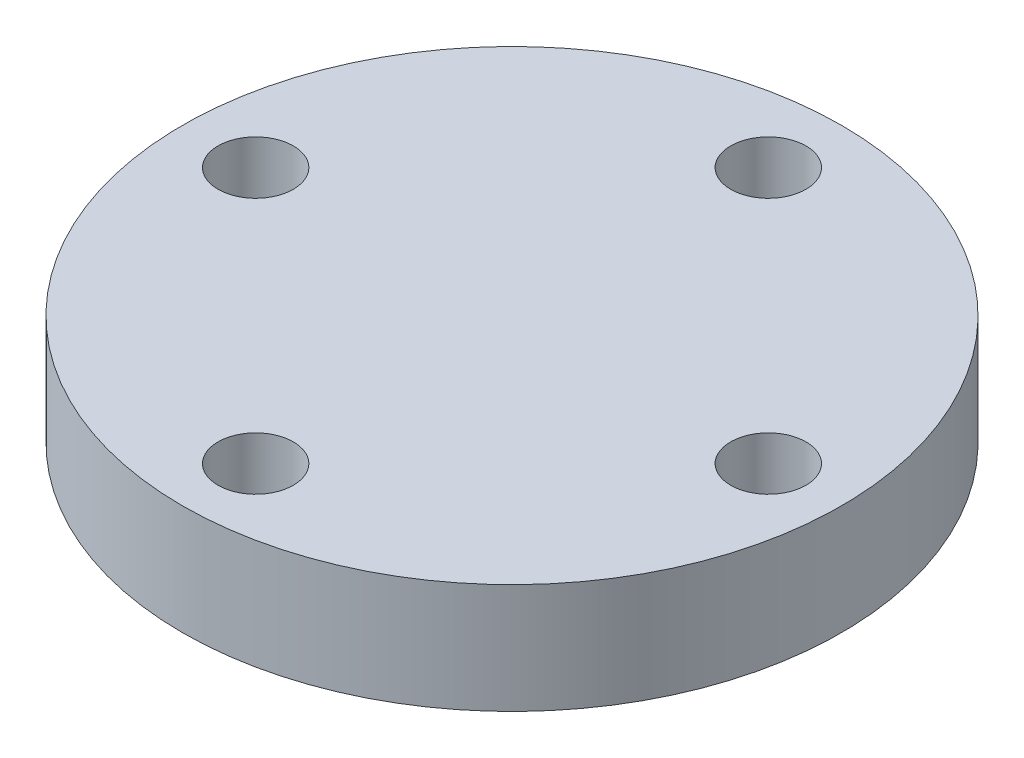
ISO-10303-21;
HEADER;
FILE_DESCRIPTION(('STEP AP214'),'2;1');
FILE_NAME('part.step','',(''),(''),'','','');
FILE_SCHEMA(('AUTOMOTIVE_DESIGN { 1 0 10303 214 1 1 1 1 }'));
ENDSEC;
DATA;
#1=APPLICATION_CONTEXT('core data for automotive mechanical design processes');
#2=APPLICATION_PROTOCOL_DEFINITION('international standard','automotive_design',2000,#1);
#3=PRODUCT_CONTEXT('',#1,'mechanical');
#4=PRODUCT('Part','Part','',(#3));
#5=PRODUCT_RELATED_PRODUCT_CATEGORY('part','',(#4));
#6=PRODUCT_DEFINITION_FORMATION('','',#4);
#7=PRODUCT_DEFINITION_CONTEXT('part definition',#1,'design');
#8=PRODUCT_DEFINITION('design','',#6,#7);
#9=PRODUCT_DEFINITION_SHAPE('','',#8);
#10=(LENGTH_UNIT() NAMED_UNIT(*) SI_UNIT(.MILLI.,.METRE.));
#11=(NAMED_UNIT(*) PLANE_ANGLE_UNIT() SI_UNIT($,.RADIAN.));
#12=(NAMED_UNIT(*) SI_UNIT($,.STERADIAN.) SOLID_ANGLE_UNIT());
#13=UNCERTAINTY_MEASURE_WITH_UNIT(LENGTH_MEASURE(1.E-05),#10,'distance_accuracy_value','');
#14=(GEOMETRIC_REPRESENTATION_CONTEXT(3) GLOBAL_UNCERTAINTY_ASSIGNED_CONTEXT((#13)) GLOBAL_UNIT_ASSIGNED_CONTEXT((#10,
#11,#12)) REPRESENTATION_CONTEXT('',''));
#15=CARTESIAN_POINT('',(0.,0.,0.));
#16=DIRECTION('',(0.,0.,1.));
#17=DIRECTION('',(1.,0.,0.));
#18=AXIS2_PLACEMENT_3D('',#15,#16,#17);
#19=CARTESIAN_POINT('',(0.,9.525,0.));
#20=DIRECTION('',(0.,-1.,0.));
#21=DIRECTION('',(0.,0.,-1.));
#22=AXIS2_PLACEMENT_3D('',#19,#20,#21);
#23=CYLINDRICAL_SURFACE('',#22,28.575);
#24=CARTESIAN_POINT('',(0.,9.525,0.));
#25=DIRECTION('',(0.,1.,0.));
#26=DIRECTION('',(0.,0.,1.));
#27=AXIS2_PLACEMENT_3D('',#24,#25,#26);
#28=CIRCLE('',#27,28.575);
#29=CARTESIAN_POINT('',(0.,9.525,-28.575));
#30=VERTEX_POINT('',#29);
#31=EDGE_CURVE('E10',#30,#30,#28,.T.);
#32=CARTESIAN_POINT('',(0.,0.,0.));
#33=DIRECTION('',(0.,1.,0.));
#34=DIRECTION('',(0.,0.,1.));
#35=AXIS2_PLACEMENT_3D('',#32,#33,#34);
#36=CIRCLE('',#35,28.575);
#37=CARTESIAN_POINT('',(0.,0.,-28.575));
#38=VERTEX_POINT('',#37);
#39=EDGE_CURVE('E35',#38,#38,#36,.T.);
#40=CARTESIAN_POINT('',(0.,9.525,-28.575));
#41=CARTESIAN_POINT('',(0.,9.42578125,-28.575));
#42=CARTESIAN_POINT('',(0.,9.3265625,-28.575));
#43=CARTESIAN_POINT('',(0.,9.128125,-28.575));
#44=CARTESIAN_POINT('',(0.,9.02890625,-28.575));
#45=CARTESIAN_POINT('',(0.,8.83046875,-28.575));
#46=CARTESIAN_POINT('',(0.,8.73125,-28.575));
#47=CARTESIAN_POINT('',(0.,8.5328125,-28.575));
#48=CARTESIAN_POINT('',(0.,8.43359375,-28.575));
#49=CARTESIAN_POINT('',(0.,8.23515625,-28.575));
#50=CARTESIAN_POINT('',(0.,8.1359375,-28.575));
#51=CARTESIAN_POINT('',(0.,7.9375,-28.575));
#52=CARTESIAN_POINT('',(0.,7.83828125,-28.575));
#53=CARTESIAN_POINT('',(0.,7.63984375,-28.575));
#54=CARTESIAN_POINT('',(0.,7.540625,-28.575));
#55=CARTESIAN_POINT('',(0.,7.3421875,-28.575));
#56=CARTESIAN_POINT('',(0.,7.24296875,-28.575));
#57=CARTESIAN_POINT('',(0.,7.04453125,-28.575));
#58=CARTESIAN_POINT('',(0.,6.9453125,-28.575));
#59=CARTESIAN_POINT('',(0.,6.746875,-28.575));
#60=CARTESIAN_POINT('',(0.,6.64765625,-28.575));
#61=CARTESIAN_POINT('',(0.,6.44921875,-28.575));
#62=CARTESIAN_POINT('',(0.,6.35,-28.575));
#63=CARTESIAN_POINT('',(0.,6.1515625,-28.575));
#64=CARTESIAN_POINT('',(0.,6.05234375,-28.575));
#65=CARTESIAN_POINT('',(0.,5.85390625,-28.575));
#66=CARTESIAN_POINT('',(0.,5.7546875,-28.575));
#67=CARTESIAN_POINT('',(0.,5.55625,-28.575));
#68=CARTESIAN_POINT('',(0.,5.45703125,-28.575));
#69=CARTESIAN_POINT('',(0.,5.25859375,-28.575));
#70=CARTESIAN_POINT('',(0.,5.159375,-28.575));
#71=CARTESIAN_POINT('',(0.,4.9609375,-28.575));
#72=CARTESIAN_POINT('',(0.,4.86171875,-28.575));
#73=CARTESIAN_POINT('',(0.,4.66328125,-28.575));
#74=CARTESIAN_POINT('',(0.,4.5640625,-28.575));
#75=CARTESIAN_POINT('',(0.,4.365625,-28.575));
#76=CARTESIAN_POINT('',(0.,4.26640625,-28.575));
#77=CARTESIAN_POINT('',(0.,4.06796875,-28.575));
#78=CARTESIAN_POINT('',(0.,3.96875,-28.575));
#79=CARTESIAN_POINT('',(0.,3.7703125,-28.575));
#80=CARTESIAN_POINT('',(0.,3.67109375,-28.575));
#81=CARTESIAN_POINT('',(0.,3.47265625,-28.575));
#82=CARTESIAN_POINT('',(0.,3.3734375,-28.575));
#83=CARTESIAN_POINT('',(0.,3.175,-28.575));
#84=CARTESIAN_POINT('',(0.,3.07578125,-28.575));
#85=CARTESIAN_POINT('',(0.,2.87734375,-28.575));
#86=CARTESIAN_POINT('',(0.,2.778125,-28.575));
#87=CARTESIAN_POINT('',(0.,2.5796875,-28.575));
#88=CARTESIAN_POINT('',(0.,2.48046875,-28.575));
#89=CARTESIAN_POINT('',(0.,2.28203125,-28.575));
#90=CARTESIAN_POINT('',(0.,2.1828125,-28.575));
#91=CARTESIAN_POINT('',(0.,1.984375,-28.575));
#92=CARTESIAN_POINT('',(0.,1.88515625,-28.575));
#93=CARTESIAN_POINT('',(0.,1.68671875,-28.575));
#94=CARTESIAN_POINT('',(0.,1.5875,-28.575));
#95=CARTESIAN_POINT('',(0.,1.3890625,-28.575));
#96=CARTESIAN_POINT('',(0.,1.28984375,-28.575));
#97=CARTESIAN_POINT('',(0.,1.09140625,-28.575));
#98=CARTESIAN_POINT('',(0.,0.992187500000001,-28.575));
#99=CARTESIAN_POINT('',(0.,0.793750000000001,-28.575));
#100=CARTESIAN_POINT('',(0.,0.69453125,-28.575));
#101=CARTESIAN_POINT('',(0.,0.49609375,-28.575));
#102=CARTESIAN_POINT('',(0.,0.396875,-28.575));
#103=CARTESIAN_POINT('',(0.,0.1984375,-28.575));
#104=CARTESIAN_POINT('',(0.,0.0992187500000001,-28.575));
#105=CARTESIAN_POINT('',(0.,0.,-28.575));
#106=B_SPLINE_CURVE_WITH_KNOTS('',3,(#40,#41,#42,#43,#44,#45,#46,#47,#48,#49,#50,#51,#52,#53,
#54,#55,#56,#57,#58,#59,#60,#61,#62,#63,#64,#65,#66,#67,#68,#69,#70,#71,#72,#73,#74,#75,#76,#77,
#78,#79,#80,#81,#82,#83,#84,#85,#86,#87,#88,#89,#90,#91,#92,#93,#94,#95,#96,#97,#98,#99,#100,
#101,#102,#103,#104,#105),.UNSPECIFIED.,.F.,.F.,(4,2,2,2,2,2,2,2,2,2,2,2,2,2,2,2,2,2,2,2,2,2,2,
2,2,2,2,2,2,2,2,2,4),(0.,0.297656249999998,0.595312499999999,0.892968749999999,1.190625,
1.48828125,1.7859375,2.08359375,2.38125,2.67890625,2.9765625,3.27421875,3.571875,3.86953125,
4.1671875,4.46484375,4.7625,5.06015625,5.3578125,5.65546875,5.953125,6.25078125,6.5484375,
6.84609375,7.14375,7.44140625,7.7390625,8.03671875,8.334375,8.63203125,8.9296875,9.22734375,
9.525),.UNSPECIFIED.);
#107=EDGE_CURVE('BSEAM32',#30,#38,#106,.T.);
#108=ORIENTED_EDGE('',*,*,#31,.F.);
#109=ORIENTED_EDGE('',*,*,#39,.T.);
#110=ORIENTED_EDGE('',*,*,#107,.T.);
#111=ORIENTED_EDGE('',*,*,#107,.F.);
#112=EDGE_LOOP('',(#108,#110,#109,#111));
#113=FACE_BOUND('',#112,.T.);
#114=ADVANCED_FACE('F32',(#113),#23,.T.);
#115=CARTESIAN_POINT('',(0.,9.525,0.));
#116=DIRECTION('',(0.,1.,0.));
#117=DIRECTION('',(0.,0.,1.));
#118=AXIS2_PLACEMENT_3D('',#115,#116,#117);
#119=PLANE('',#118);
#120=CARTESIAN_POINT('',(0.,9.525,-22.225));
#121=DIRECTION('',(0.,1.,0.));
#122=DIRECTION('',(0.,0.,1.));
#123=AXIS2_PLACEMENT_3D('',#120,#121,#122);
#124=CIRCLE('',#123,3.2639);
#125=CARTESIAN_POINT('',(0.,9.525,-18.9611));
#126=VERTEX_POINT('',#125);
#127=EDGE_CURVE('E62',#126,#126,#124,.T.);
#128=ORIENTED_EDGE('',*,*,#127,.F.);
#129=EDGE_LOOP('',(#128));
#130=FACE_BOUND('',#129,.T.);
#131=CARTESIAN_POINT('',(22.225,9.525,0.));
#132=DIRECTION('',(0.,1.,0.));
#133=DIRECTION('',(0.,0.,1.));
#134=AXIS2_PLACEMENT_3D('',#131,#132,#133);
#135=CIRCLE('',#134,3.2639);
#136=CARTESIAN_POINT('',(22.225,9.525,3.26390000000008));
#137=VERTEX_POINT('',#136);
#138=EDGE_CURVE('E56',#137,#137,#135,.T.);
#139=ORIENTED_EDGE('',*,*,#138,.F.);
#140=EDGE_LOOP('',(#139));
#141=FACE_BOUND('',#140,.T.);
#142=CARTESIAN_POINT('',(1.25790142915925E-12,9.525,22.225));
#143=DIRECTION('',(0.,1.,0.));
#144=DIRECTION('',(0.,0.,1.));
#145=AXIS2_PLACEMENT_3D('',#142,#143,#144);
#146=CIRCLE('',#145,3.2639);
#147=CARTESIAN_POINT('',(1.25790142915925E-12,9.525,25.4889));
#148=VERTEX_POINT('',#147);
#149=EDGE_CURVE('E50',#148,#148,#146,.T.);
#150=ORIENTED_EDGE('',*,*,#149,.F.);
#151=EDGE_LOOP('',(#150));
#152=FACE_BOUND('',#151,.T.);
#153=CARTESIAN_POINT('',(-22.2249999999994,9.525,6.31672492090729E-13));
#154=DIRECTION('',(0.,1.,0.));
#155=DIRECTION('',(0.,0.,1.));
#156=AXIS2_PLACEMENT_3D('',#153,#154,#155);
#157=CIRCLE('',#156,3.2639);
#158=CARTESIAN_POINT('',(-22.2249999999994,9.525,3.26390000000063));
#159=VERTEX_POINT('',#158);
#160=EDGE_CURVE('E44',#159,#159,#157,.T.);
#161=ORIENTED_EDGE('',*,*,#160,.F.);
#162=EDGE_LOOP('',(#161));
#163=FACE_BOUND('',#162,.T.);
#164=ORIENTED_EDGE('',*,*,#31,.T.);
#165=EDGE_LOOP('',(#164));
#166=FACE_BOUND('',#165,.T.);
#167=ADVANCED_FACE('F78',(#130,#141,#152,#163,#166),#119,.T.);
#168=CARTESIAN_POINT('',(0.,0.,0.));
#169=DIRECTION('',(0.,1.,0.));
#170=DIRECTION('',(0.,0.,1.));
#171=AXIS2_PLACEMENT_3D('',#168,#169,#170);
#172=PLANE('',#171);
#173=CARTESIAN_POINT('',(0.,0.,-22.225));
#174=DIRECTION('',(0.,1.,0.));
#175=DIRECTION('',(0.,0.,1.));
#176=AXIS2_PLACEMENT_3D('',#173,#174,#175);
#177=CIRCLE('',#176,3.2639);
#178=CARTESIAN_POINT('',(0.,0.,-18.9611));
#179=VERTEX_POINT('',#178);
#180=EDGE_CURVE('E42',#179,#179,#177,.T.);
#181=ORIENTED_EDGE('',*,*,#180,.T.);
#182=EDGE_LOOP('',(#181));
#183=FACE_BOUND('',#182,.T.);
#184=CARTESIAN_POINT('',(22.225,0.,0.));
#185=DIRECTION('',(0.,1.,0.));
#186=DIRECTION('',(0.,0.,1.));
#187=AXIS2_PLACEMENT_3D('',#184,#185,#186);
#188=CIRCLE('',#187,3.2639);
#189=CARTESIAN_POINT('',(22.225,0.,3.26390000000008));
#190=VERTEX_POINT('',#189);
#191=EDGE_CURVE('E59',#190,#190,#188,.T.);
#192=ORIENTED_EDGE('',*,*,#191,.T.);
#193=EDGE_LOOP('',(#192));
#194=FACE_BOUND('',#193,.T.);
#195=CARTESIAN_POINT('',(1.25790142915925E-12,0.,22.225));
#196=DIRECTION('',(0.,1.,0.));
#197=DIRECTION('',(0.,0.,1.));
#198=AXIS2_PLACEMENT_3D('',#195,#196,#197);
#199=CIRCLE('',#198,3.2639);
#200=CARTESIAN_POINT('',(1.25790142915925E-12,0.,25.4889));
#201=VERTEX_POINT('',#200);
#202=EDGE_CURVE('E53',#201,#201,#199,.T.);
#203=ORIENTED_EDGE('',*,*,#202,.T.);
#204=EDGE_LOOP('',(#203));
#205=FACE_BOUND('',#204,.T.);
#206=CARTESIAN_POINT('',(-22.2249999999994,0.,6.31672492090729E-13));
#207=DIRECTION('',(0.,1.,0.));
#208=DIRECTION('',(0.,0.,1.));
#209=AXIS2_PLACEMENT_3D('',#206,#207,#208);
#210=CIRCLE('',#209,3.2639);
#211=CARTESIAN_POINT('',(-22.2249999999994,0.,3.26390000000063));
#212=VERTEX_POINT('',#211);
#213=EDGE_CURVE('E47',#212,#212,#210,.T.);
#214=ORIENTED_EDGE('',*,*,#213,.T.);
#215=EDGE_LOOP('',(#214));
#216=FACE_BOUND('',#215,.T.);
#217=ORIENTED_EDGE('',*,*,#39,.F.);
#218=EDGE_LOOP('',(#217));
#219=FACE_BOUND('',#218,.T.);
#220=ADVANCED_FACE('F68',(#183,#194,#205,#216,#219),#172,.F.);
#221=CARTESIAN_POINT('',(-22.2249999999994,0.,6.31672492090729E-13));
#222=DIRECTION('',(0.,1.,0.));
#223=DIRECTION('',(0.,0.,1.));
#224=AXIS2_PLACEMENT_3D('',#221,#222,#223);
#225=CYLINDRICAL_SURFACE('',#224,3.2639);
#226=CARTESIAN_POINT('',(-22.2249999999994,0.,3.26390000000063));
#227=CARTESIAN_POINT('',(-22.2249999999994,0.0992187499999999,3.26390000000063));
#228=CARTESIAN_POINT('',(-22.2249999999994,0.1984375,3.26390000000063));
#229=CARTESIAN_POINT('',(-22.2249999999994,0.396875,3.26390000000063));
#230=CARTESIAN_POINT('',(-22.2249999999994,0.49609375,3.26390000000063));
#231=CARTESIAN_POINT('',(-22.2249999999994,0.69453125,3.26390000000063));
#232=CARTESIAN_POINT('',(-22.2249999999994,0.79375,3.26390000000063));
#233=CARTESIAN_POINT('',(-22.2249999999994,0.9921875,3.26390000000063));
#234=CARTESIAN_POINT('',(-22.2249999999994,1.09140625,3.26390000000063));
#235=CARTESIAN_POINT('',(-22.2249999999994,1.28984375,3.26390000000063));
#236=CARTESIAN_POINT('',(-22.2249999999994,1.3890625,3.26390000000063));
#237=CARTESIAN_POINT('',(-22.2249999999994,1.5875,3.26390000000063));
#238=CARTESIAN_POINT('',(-22.2249999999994,1.68671875,3.26390000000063));
#239=CARTESIAN_POINT('',(-22.2249999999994,1.88515625,3.26390000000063));
#240=CARTESIAN_POINT('',(-22.2249999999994,1.984375,3.26390000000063));
#241=CARTESIAN_POINT('',(-22.2249999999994,2.1828125,3.26390000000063));
#242=CARTESIAN_POINT('',(-22.2249999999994,2.28203125,3.26390000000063));
#243=CARTESIAN_POINT('',(-22.2249999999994,2.48046875,3.26390000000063));
#244=CARTESIAN_POINT('',(-22.2249999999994,2.5796875,3.26390000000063));
#245=CARTESIAN_POINT('',(-22.2249999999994,2.778125,3.26390000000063));
#246=CARTESIAN_POINT('',(-22.2249999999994,2.87734375,3.26390000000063));
#247=CARTESIAN_POINT('',(-22.2249999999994,3.07578125,3.26390000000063));
#248=CARTESIAN_POINT('',(-22.2249999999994,3.175,3.26390000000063));
#249=CARTESIAN_POINT('',(-22.2249999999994,3.3734375,3.26390000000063));
#250=CARTESIAN_POINT('',(-22.2249999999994,3.47265625,3.26390000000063));
#251=CARTESIAN_POINT('',(-22.2249999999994,3.67109375,3.26390000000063));
#252=CARTESIAN_POINT('',(-22.2249999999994,3.7703125,3.26390000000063));
#253=CARTESIAN_POINT('',(-22.2249999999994,3.96875,3.26390000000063));
#254=CARTESIAN_POINT('',(-22.2249999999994,4.06796875,3.26390000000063));
#255=CARTESIAN_POINT('',(-22.2249999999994,4.26640625,3.26390000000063));
#256=CARTESIAN_POINT('',(-22.2249999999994,4.365625,3.26390000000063));
#257=CARTESIAN_POINT('',(-22.2249999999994,4.5640625,3.26390000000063));
#258=CARTESIAN_POINT('',(-22.2249999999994,4.66328125,3.26390000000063));
#259=CARTESIAN_POINT('',(-22.2249999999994,4.86171875,3.26390000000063));
#260=CARTESIAN_POINT('',(-22.2249999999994,4.9609375,3.26390000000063));
#261=CARTESIAN_POINT('',(-22.2249999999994,5.159375,3.26390000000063));
#262=CARTESIAN_POINT('',(-22.2249999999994,5.25859375,3.26390000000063));
#263=CARTESIAN_POINT('',(-22.2249999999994,5.45703125,3.26390000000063));
#264=CARTESIAN_POINT('',(-22.2249999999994,5.55625,3.26390000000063));
#265=CARTESIAN_POINT('',(-22.2249999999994,5.7546875,3.26390000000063));
#266=CARTESIAN_POINT('',(-22.2249999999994,5.85390625,3.26390000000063));
#267=CARTESIAN_POINT('',(-22.2249999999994,6.05234375,3.26390000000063));
#268=CARTESIAN_POINT('',(-22.2249999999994,6.1515625,3.26390000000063));
#269=CARTESIAN_POINT('',(-22.2249999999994,6.35,3.26390000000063));
#270=CARTESIAN_POINT('',(-22.2249999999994,6.44921875,3.26390000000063));
#271=CARTESIAN_POINT('',(-22.2249999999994,6.64765625,3.26390000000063));
#272=CARTESIAN_POINT('',(-22.2249999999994,6.746875,3.26390000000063));
#273=CARTESIAN_POINT('',(-22.2249999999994,6.9453125,3.26390000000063));
#274=CARTESIAN_POINT('',(-22.2249999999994,7.04453125,3.26390000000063));
#275=CARTESIAN_POINT('',(-22.2249999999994,7.24296875,3.26390000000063));
#276=CARTESIAN_POINT('',(-22.2249999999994,7.3421875,3.26390000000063));
#277=CARTESIAN_POINT('',(-22.2249999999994,7.540625,3.26390000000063));
#278=CARTESIAN_POINT('',(-22.2249999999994,7.63984375,3.26390000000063));
#279=CARTESIAN_POINT('',(-22.2249999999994,7.83828125,3.26390000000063));
#280=CARTESIAN_POINT('',(-22.2249999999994,7.9375,3.26390000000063));
#281=CARTESIAN_POINT('',(-22.2249999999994,8.1359375,3.26390000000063));
#282=CARTESIAN_POINT('',(-22.2249999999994,8.23515625,3.26390000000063));
#283=CARTESIAN_POINT('',(-22.2249999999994,8.43359375,3.26390000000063));
#284=CARTESIAN_POINT('',(-22.2249999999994,8.5328125,3.26390000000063));
#285=CARTESIAN_POINT('',(-22.2249999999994,8.73125,3.26390000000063));
#286=CARTESIAN_POINT('',(-22.2249999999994,8.83046875,3.26390000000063));
#287=CARTESIAN_POINT('',(-22.2249999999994,9.02890625,3.26390000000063));
#288=CARTESIAN_POINT('',(-22.2249999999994,9.128125,3.26390000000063));
#289=CARTESIAN_POINT('',(-22.2249999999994,9.3265625,3.26390000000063));
#290=CARTESIAN_POINT('',(-22.2249999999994,9.42578125,3.26390000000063));
#291=CARTESIAN_POINT('',(-22.2249999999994,9.525,3.26390000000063));
#292=B_SPLINE_CURVE_WITH_KNOTS('',3,(#226,#227,#228,#229,#230,#231,#232,#233,#234,#235,#236,
#237,#238,#239,#240,#241,#242,#243,#244,#245,#246,#247,#248,#249,#250,#251,#252,#253,#254,#255,
#256,#257,#258,#259,#260,#261,#262,#263,#264,#265,#266,#267,#268,#269,#270,#271,#272,#273,#274,
#275,#276,#277,#278,#279,#280,#281,#282,#283,#284,#285,#286,#287,#288,#289,#290,#291),
.UNSPECIFIED.,.F.,.F.,(4,2,2,2,2,2,2,2,2,2,2,2,2,2,2,2,2,2,2,2,2,2,2,2,2,2,2,2,2,2,2,2,4),(0.,
0.29765625,0.5953125,0.89296875,1.190625,1.48828125,1.7859375,2.08359375,2.38125,2.67890625,
2.9765625,3.27421875,3.571875,3.86953125,4.1671875,4.46484375,4.7625,5.06015625,5.3578125,
5.65546875,5.953125,6.25078125,6.5484375,6.84609375,7.14375,7.44140625,7.7390625,8.03671875,
8.334375,8.63203125,8.9296875,9.22734375,9.525),.UNSPECIFIED.);
#293=EDGE_CURVE('BSEAM88',#212,#159,#292,.T.);
#294=ORIENTED_EDGE('',*,*,#213,.F.);
#295=ORIENTED_EDGE('',*,*,#160,.T.);
#296=ORIENTED_EDGE('',*,*,#293,.T.);
#297=ORIENTED_EDGE('',*,*,#293,.F.);
#298=EDGE_LOOP('',(#294,#296,#295,#297));
#299=FACE_BOUND('',#298,.T.);
#300=ADVANCED_FACE('F88',(#299),#225,.F.);
#301=CARTESIAN_POINT('',(1.25790142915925E-12,0.,22.225));
#302=DIRECTION('',(0.,1.,0.));
#303=DIRECTION('',(0.,0.,1.));
#304=AXIS2_PLACEMENT_3D('',#301,#302,#303);
#305=CYLINDRICAL_SURFACE('',#304,3.2639);
#306=CARTESIAN_POINT('',(1.25790142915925E-12,0.,25.4889));
#307=CARTESIAN_POINT('',(1.25790142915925E-12,0.0992187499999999,25.4889));
#308=CARTESIAN_POINT('',(1.25790142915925E-12,0.1984375,25.4889));
#309=CARTESIAN_POINT('',(1.25790142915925E-12,0.396875,25.4889));
#310=CARTESIAN_POINT('',(1.25790142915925E-12,0.49609375,25.4889));
#311=CARTESIAN_POINT('',(1.25790142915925E-12,0.69453125,25.4889));
#312=CARTESIAN_POINT('',(1.25790142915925E-12,0.79375,25.4889));
#313=CARTESIAN_POINT('',(1.25790142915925E-12,0.9921875,25.4889));
#314=CARTESIAN_POINT('',(1.25790142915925E-12,1.09140625,25.4889));
#315=CARTESIAN_POINT('',(1.25790142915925E-12,1.28984375,25.4889));
#316=CARTESIAN_POINT('',(1.25790142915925E-12,1.3890625,25.4889));
#317=CARTESIAN_POINT('',(1.25790142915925E-12,1.5875,25.4889));
#318=CARTESIAN_POINT('',(1.25790142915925E-12,1.68671875,25.4889));
#319=CARTESIAN_POINT('',(1.25790142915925E-12,1.88515625,25.4889));
#320=CARTESIAN_POINT('',(1.25790142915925E-12,1.984375,25.4889));
#321=CARTESIAN_POINT('',(1.25790142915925E-12,2.1828125,25.4889));
#322=CARTESIAN_POINT('',(1.25790142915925E-12,2.28203125,25.4889));
#323=CARTESIAN_POINT('',(1.25790142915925E-12,2.48046875,25.4889));
#324=CARTESIAN_POINT('',(1.25790142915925E-12,2.5796875,25.4889));
#325=CARTESIAN_POINT('',(1.25790142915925E-12,2.778125,25.4889));
#326=CARTESIAN_POINT('',(1.25790142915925E-12,2.87734375,25.4889));
#327=CARTESIAN_POINT('',(1.25790142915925E-12,3.07578125,25.4889));
#328=CARTESIAN_POINT('',(1.25790142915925E-12,3.175,25.4889));
#329=CARTESIAN_POINT('',(1.25790142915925E-12,3.3734375,25.4889));
#330=CARTESIAN_POINT('',(1.25790142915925E-12,3.47265625,25.4889));
#331=CARTESIAN_POINT('',(1.25790142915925E-12,3.67109375,25.4889));
#332=CARTESIAN_POINT('',(1.25790142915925E-12,3.7703125,25.4889));
#333=CARTESIAN_POINT('',(1.25790142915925E-12,3.96875,25.4889));
#334=CARTESIAN_POINT('',(1.25790142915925E-12,4.06796875,25.4889));
#335=CARTESIAN_POINT('',(1.25790142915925E-12,4.26640625,25.4889));
#336=CARTESIAN_POINT('',(1.25790142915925E-12,4.365625,25.4889));
#337=CARTESIAN_POINT('',(1.25790142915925E-12,4.5640625,25.4889));
#338=CARTESIAN_POINT('',(1.25790142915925E-12,4.66328125,25.4889));
#339=CARTESIAN_POINT('',(1.25790142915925E-12,4.86171875,25.4889));
#340=CARTESIAN_POINT('',(1.25790142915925E-12,4.9609375,25.4889));
#341=CARTESIAN_POINT('',(1.25790142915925E-12,5.159375,25.4889));
#342=CARTESIAN_POINT('',(1.25790142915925E-12,5.25859375,25.4889));
#343=CARTESIAN_POINT('',(1.25790142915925E-12,5.45703125,25.4889));
#344=CARTESIAN_POINT('',(1.25790142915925E-12,5.55625,25.4889));
#345=CARTESIAN_POINT('',(1.25790142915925E-12,5.7546875,25.4889));
#346=CARTESIAN_POINT('',(1.25790142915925E-12,5.85390625,25.4889));
#347=CARTESIAN_POINT('',(1.25790142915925E-12,6.05234375,25.4889));
#348=CARTESIAN_POINT('',(1.25790142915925E-12,6.1515625,25.4889));
#349=CARTESIAN_POINT('',(1.25790142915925E-12,6.35,25.4889));
#350=CARTESIAN_POINT('',(1.25790142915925E-12,6.44921875,25.4889));
#351=CARTESIAN_POINT('',(1.25790142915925E-12,6.64765625,25.4889));
#352=CARTESIAN_POINT('',(1.25790142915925E-12,6.746875,25.4889));
#353=CARTESIAN_POINT('',(1.25790142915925E-12,6.9453125,25.4889));
#354=CARTESIAN_POINT('',(1.25790142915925E-12,7.04453125,25.4889));
#355=CARTESIAN_POINT('',(1.25790142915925E-12,7.24296875,25.4889));
#356=CARTESIAN_POINT('',(1.25790142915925E-12,7.3421875,25.4889));
#357=CARTESIAN_POINT('',(1.25790142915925E-12,7.540625,25.4889));
#358=CARTESIAN_POINT('',(1.25790142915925E-12,7.63984375,25.4889));
#359=CARTESIAN_POINT('',(1.25790142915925E-12,7.83828125,25.4889));
#360=CARTESIAN_POINT('',(1.25790142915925E-12,7.9375,25.4889));
#361=CARTESIAN_POINT('',(1.25790142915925E-12,8.1359375,25.4889));
#362=CARTESIAN_POINT('',(1.25790142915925E-12,8.23515625,25.4889));
#363=CARTESIAN_POINT('',(1.25790142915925E-12,8.43359375,25.4889));
#364=CARTESIAN_POINT('',(1.25790142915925E-12,8.5328125,25.4889));
#365=CARTESIAN_POINT('',(1.25790142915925E-12,8.73125,25.4889));
#366=CARTESIAN_POINT('',(1.25790142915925E-12,8.83046875,25.4889));
#367=CARTESIAN_POINT('',(1.25790142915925E-12,9.02890625,25.4889));
#368=CARTESIAN_POINT('',(1.25790142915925E-12,9.128125,25.4889));
#369=CARTESIAN_POINT('',(1.25790142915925E-12,9.3265625,25.4889));
#370=CARTESIAN_POINT('',(1.25790142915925E-12,9.42578125,25.4889));
#371=CARTESIAN_POINT('',(1.25790142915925E-12,9.525,25.4889));
#372=B_SPLINE_CURVE_WITH_KNOTS('',3,(#306,#307,#308,#309,#310,#311,#312,#313,#314,#315,#316,
#317,#318,#319,#320,#321,#322,#323,#324,#325,#326,#327,#328,#329,#330,#331,#332,#333,#334,#335,
#336,#337,#338,#339,#340,#341,#342,#343,#344,#345,#346,#347,#348,#349,#350,#351,#352,#353,#354,
#355,#356,#357,#358,#359,#360,#361,#362,#363,#364,#365,#366,#367,#368,#369,#370,#371),
.UNSPECIFIED.,.F.,.F.,(4,2,2,2,2,2,2,2,2,2,2,2,2,2,2,2,2,2,2,2,2,2,2,2,2,2,2,2,2,2,2,2,4),(0.,
0.29765625,0.5953125,0.89296875,1.190625,1.48828125,1.7859375,2.08359375,2.38125,2.67890625,
2.9765625,3.27421875,3.571875,3.86953125,4.1671875,4.46484375,4.7625,5.06015625,5.3578125,
5.65546875,5.953125,6.25078125,6.5484375,6.84609375,7.14375,7.44140625,7.7390625,8.03671875,
8.334375,8.63203125,8.9296875,9.22734375,9.525),.UNSPECIFIED.);
#373=EDGE_CURVE('BSEAM90',#201,#148,#372,.T.);
#374=ORIENTED_EDGE('',*,*,#202,.F.);
#375=ORIENTED_EDGE('',*,*,#149,.T.);
#376=ORIENTED_EDGE('',*,*,#373,.T.);
#377=ORIENTED_EDGE('',*,*,#373,.F.);
#378=EDGE_LOOP('',(#374,#376,#375,#377));
#379=FACE_BOUND('',#378,.T.);
#380=ADVANCED_FACE('F90',(#379),#305,.F.);
#381=CARTESIAN_POINT('',(22.225,0.,0.));
#382=DIRECTION('',(0.,1.,0.));
#383=DIRECTION('',(0.,0.,1.));
#384=AXIS2_PLACEMENT_3D('',#381,#382,#383);
#385=CYLINDRICAL_SURFACE('',#384,3.2639);
#386=CARTESIAN_POINT('',(22.225,0.,3.26390000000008));
#387=CARTESIAN_POINT('',(22.225,0.0992187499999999,3.26390000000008));
#388=CARTESIAN_POINT('',(22.225,0.1984375,3.26390000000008));
#389=CARTESIAN_POINT('',(22.225,0.396875,3.26390000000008));
#390=CARTESIAN_POINT('',(22.225,0.49609375,3.26390000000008));
#391=CARTESIAN_POINT('',(22.225,0.69453125,3.26390000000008));
#392=CARTESIAN_POINT('',(22.225,0.79375,3.26390000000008));
#393=CARTESIAN_POINT('',(22.225,0.9921875,3.26390000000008));
#394=CARTESIAN_POINT('',(22.225,1.09140625,3.26390000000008));
#395=CARTESIAN_POINT('',(22.225,1.28984375,3.26390000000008));
#396=CARTESIAN_POINT('',(22.225,1.3890625,3.26390000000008));
#397=CARTESIAN_POINT('',(22.225,1.5875,3.26390000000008));
#398=CARTESIAN_POINT('',(22.225,1.68671875,3.26390000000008));
#399=CARTESIAN_POINT('',(22.225,1.88515625,3.26390000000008));
#400=CARTESIAN_POINT('',(22.225,1.984375,3.26390000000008));
#401=CARTESIAN_POINT('',(22.225,2.1828125,3.26390000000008));
#402=CARTESIAN_POINT('',(22.225,2.28203125,3.26390000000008));
#403=CARTESIAN_POINT('',(22.225,2.48046875,3.26390000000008));
#404=CARTESIAN_POINT('',(22.225,2.5796875,3.26390000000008));
#405=CARTESIAN_POINT('',(22.225,2.778125,3.26390000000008));
#406=CARTESIAN_POINT('',(22.225,2.87734375,3.26390000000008));
#407=CARTESIAN_POINT('',(22.225,3.07578125,3.26390000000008));
#408=CARTESIAN_POINT('',(22.225,3.175,3.26390000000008));
#409=CARTESIAN_POINT('',(22.225,3.3734375,3.26390000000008));
#410=CARTESIAN_POINT('',(22.225,3.47265625,3.26390000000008));
#411=CARTESIAN_POINT('',(22.225,3.67109375,3.26390000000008));
#412=CARTESIAN_POINT('',(22.225,3.7703125,3.26390000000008));
#413=CARTESIAN_POINT('',(22.225,3.96875,3.26390000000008));
#414=CARTESIAN_POINT('',(22.225,4.06796875,3.26390000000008));
#415=CARTESIAN_POINT('',(22.225,4.26640625,3.26390000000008));
#416=CARTESIAN_POINT('',(22.225,4.365625,3.26390000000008));
#417=CARTESIAN_POINT('',(22.225,4.5640625,3.26390000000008));
#418=CARTESIAN_POINT('',(22.225,4.66328125,3.26390000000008));
#419=CARTESIAN_POINT('',(22.225,4.86171875,3.26390000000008));
#420=CARTESIAN_POINT('',(22.225,4.9609375,3.26390000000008));
#421=CARTESIAN_POINT('',(22.225,5.159375,3.26390000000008));
#422=CARTESIAN_POINT('',(22.225,5.25859375,3.26390000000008));
#423=CARTESIAN_POINT('',(22.225,5.45703125,3.26390000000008));
#424=CARTESIAN_POINT('',(22.225,5.55625,3.26390000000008));
#425=CARTESIAN_POINT('',(22.225,5.7546875,3.26390000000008));
#426=CARTESIAN_POINT('',(22.225,5.85390625,3.26390000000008));
#427=CARTESIAN_POINT('',(22.225,6.05234375,3.26390000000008));
#428=CARTESIAN_POINT('',(22.225,6.1515625,3.26390000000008));
#429=CARTESIAN_POINT('',(22.225,6.35,3.26390000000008));
#430=CARTESIAN_POINT('',(22.225,6.44921875,3.26390000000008));
#431=CARTESIAN_POINT('',(22.225,6.64765625,3.26390000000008));
#432=CARTESIAN_POINT('',(22.225,6.746875,3.26390000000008));
#433=CARTESIAN_POINT('',(22.225,6.9453125,3.26390000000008));
#434=CARTESIAN_POINT('',(22.225,7.04453125,3.26390000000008));
#435=CARTESIAN_POINT('',(22.225,7.24296875,3.26390000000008));
#436=CARTESIAN_POINT('',(22.225,7.3421875,3.26390000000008));
#437=CARTESIAN_POINT('',(22.225,7.540625,3.26390000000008));
#438=CARTESIAN_POINT('',(22.225,7.63984375,3.26390000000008));
#439=CARTESIAN_POINT('',(22.225,7.83828125,3.26390000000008));
#440=CARTESIAN_POINT('',(22.225,7.9375,3.26390000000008));
#441=CARTESIAN_POINT('',(22.225,8.1359375,3.26390000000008));
#442=CARTESIAN_POINT('',(22.225,8.23515625,3.26390000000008));
#443=CARTESIAN_POINT('',(22.225,8.43359375,3.26390000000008));
#444=CARTESIAN_POINT('',(22.225,8.5328125,3.26390000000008));
#445=CARTESIAN_POINT('',(22.225,8.73125,3.26390000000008));
#446=CARTESIAN_POINT('',(22.225,8.83046875,3.26390000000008));
#447=CARTESIAN_POINT('',(22.225,9.02890625,3.26390000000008));
#448=CARTESIAN_POINT('',(22.225,9.128125,3.26390000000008));
#449=CARTESIAN_POINT('',(22.225,9.3265625,3.26390000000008));
#450=CARTESIAN_POINT('',(22.225,9.42578125,3.26390000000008));
#451=CARTESIAN_POINT('',(22.225,9.525,3.26390000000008));
#452=B_SPLINE_CURVE_WITH_KNOTS('',3,(#386,#387,#388,#389,#390,#391,#392,#393,#394,#395,#396,
#397,#398,#399,#400,#401,#402,#403,#404,#405,#406,#407,#408,#409,#410,#411,#412,#413,#414,#415,
#416,#417,#418,#419,#420,#421,#422,#423,#424,#425,#426,#427,#428,#429,#430,#431,#432,#433,#434,
#435,#436,#437,#438,#439,#440,#441,#442,#443,#444,#445,#446,#447,#448,#449,#450,#451),
.UNSPECIFIED.,.F.,.F.,(4,2,2,2,2,2,2,2,2,2,2,2,2,2,2,2,2,2,2,2,2,2,2,2,2,2,2,2,2,2,2,2,4),(0.,
0.29765625,0.5953125,0.89296875,1.190625,1.48828125,1.7859375,2.08359375,2.38125,2.67890625,
2.9765625,3.27421875,3.571875,3.86953125,4.1671875,4.46484375,4.7625,5.06015625,5.3578125,
5.65546875,5.953125,6.25078125,6.5484375,6.84609375,7.14375,7.44140625,7.7390625,8.03671875,
8.334375,8.63203125,8.9296875,9.22734375,9.525),.UNSPECIFIED.);
#453=EDGE_CURVE('BSEAM74',#190,#137,#452,.T.);
#454=ORIENTED_EDGE('',*,*,#191,.F.);
#455=ORIENTED_EDGE('',*,*,#138,.T.);
#456=ORIENTED_EDGE('',*,*,#453,.T.);
#457=ORIENTED_EDGE('',*,*,#453,.F.);
#458=EDGE_LOOP('',(#454,#456,#455,#457));
#459=FACE_BOUND('',#458,.T.);
#460=ADVANCED_FACE('F74',(#459),#385,.F.);
#461=CARTESIAN_POINT('',(0.,0.,-22.225));
#462=DIRECTION('',(0.,1.,0.));
#463=DIRECTION('',(0.,0.,1.));
#464=AXIS2_PLACEMENT_3D('',#461,#462,#463);
#465=CYLINDRICAL_SURFACE('',#464,3.2639);
#466=CARTESIAN_POINT('',(0.,0.,-18.9611));
#467=CARTESIAN_POINT('',(0.,0.0992187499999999,-18.9611));
#468=CARTESIAN_POINT('',(0.,0.1984375,-18.9611));
#469=CARTESIAN_POINT('',(0.,0.396875,-18.9611));
#470=CARTESIAN_POINT('',(0.,0.49609375,-18.9611));
#471=CARTESIAN_POINT('',(0.,0.69453125,-18.9611));
#472=CARTESIAN_POINT('',(0.,0.79375,-18.9611));
#473=CARTESIAN_POINT('',(0.,0.9921875,-18.9611));
#474=CARTESIAN_POINT('',(0.,1.09140625,-18.9611));
#475=CARTESIAN_POINT('',(0.,1.28984375,-18.9611));
#476=CARTESIAN_POINT('',(0.,1.3890625,-18.9611));
#477=CARTESIAN_POINT('',(0.,1.5875,-18.9611));
#478=CARTESIAN_POINT('',(0.,1.68671875,-18.9611));
#479=CARTESIAN_POINT('',(0.,1.88515625,-18.9611));
#480=CARTESIAN_POINT('',(0.,1.984375,-18.9611));
#481=CARTESIAN_POINT('',(0.,2.1828125,-18.9611));
#482=CARTESIAN_POINT('',(0.,2.28203125,-18.9611));
#483=CARTESIAN_POINT('',(0.,2.48046875,-18.9611));
#484=CARTESIAN_POINT('',(0.,2.5796875,-18.9611));
#485=CARTESIAN_POINT('',(0.,2.778125,-18.9611));
#486=CARTESIAN_POINT('',(0.,2.87734375,-18.9611));
#487=CARTESIAN_POINT('',(0.,3.07578125,-18.9611));
#488=CARTESIAN_POINT('',(0.,3.175,-18.9611));
#489=CARTESIAN_POINT('',(0.,3.3734375,-18.9611));
#490=CARTESIAN_POINT('',(0.,3.47265625,-18.9611));
#491=CARTESIAN_POINT('',(0.,3.67109375,-18.9611));
#492=CARTESIAN_POINT('',(0.,3.7703125,-18.9611));
#493=CARTESIAN_POINT('',(0.,3.96875,-18.9611));
#494=CARTESIAN_POINT('',(0.,4.06796875,-18.9611));
#495=CARTESIAN_POINT('',(0.,4.26640625,-18.9611));
#496=CARTESIAN_POINT('',(0.,4.365625,-18.9611));
#497=CARTESIAN_POINT('',(0.,4.5640625,-18.9611));
#498=CARTESIAN_POINT('',(0.,4.66328125,-18.9611));
#499=CARTESIAN_POINT('',(0.,4.86171875,-18.9611));
#500=CARTESIAN_POINT('',(0.,4.9609375,-18.9611));
#501=CARTESIAN_POINT('',(0.,5.159375,-18.9611));
#502=CARTESIAN_POINT('',(0.,5.25859375,-18.9611));
#503=CARTESIAN_POINT('',(0.,5.45703125,-18.9611));
#504=CARTESIAN_POINT('',(0.,5.55625,-18.9611));
#505=CARTESIAN_POINT('',(0.,5.7546875,-18.9611));
#506=CARTESIAN_POINT('',(0.,5.85390625,-18.9611));
#507=CARTESIAN_POINT('',(0.,6.05234375,-18.9611));
#508=CARTESIAN_POINT('',(0.,6.1515625,-18.9611));
#509=CARTESIAN_POINT('',(0.,6.35,-18.9611));
#510=CARTESIAN_POINT('',(0.,6.44921875,-18.9611));
#511=CARTESIAN_POINT('',(0.,6.64765625,-18.9611));
#512=CARTESIAN_POINT('',(0.,6.746875,-18.9611));
#513=CARTESIAN_POINT('',(0.,6.9453125,-18.9611));
#514=CARTESIAN_POINT('',(0.,7.04453125,-18.9611));
#515=CARTESIAN_POINT('',(0.,7.24296875,-18.9611));
#516=CARTESIAN_POINT('',(0.,7.3421875,-18.9611));
#517=CARTESIAN_POINT('',(0.,7.540625,-18.9611));
#518=CARTESIAN_POINT('',(0.,7.63984375,-18.9611));
#519=CARTESIAN_POINT('',(0.,7.83828125,-18.9611));
#520=CARTESIAN_POINT('',(0.,7.9375,-18.9611));
#521=CARTESIAN_POINT('',(0.,8.1359375,-18.9611));
#522=CARTESIAN_POINT('',(0.,8.23515625,-18.9611));
#523=CARTESIAN_POINT('',(0.,8.43359375,-18.9611));
#524=CARTESIAN_POINT('',(0.,8.5328125,-18.9611));
#525=CARTESIAN_POINT('',(0.,8.73125,-18.9611));
#526=CARTESIAN_POINT('',(0.,8.83046875,-18.9611));
#527=CARTESIAN_POINT('',(0.,9.02890625,-18.9611));
#528=CARTESIAN_POINT('',(0.,9.128125,-18.9611));
#529=CARTESIAN_POINT('',(0.,9.3265625,-18.9611));
#530=CARTESIAN_POINT('',(0.,9.42578125,-18.9611));
#531=CARTESIAN_POINT('',(0.,9.525,-18.9611));
#532=B_SPLINE_CURVE_WITH_KNOTS('',3,(#466,#467,#468,#469,#470,#471,#472,#473,#474,#475,#476,
#477,#478,#479,#480,#481,#482,#483,#484,#485,#486,#487,#488,#489,#490,#491,#492,#493,#494,#495,
#496,#497,#498,#499,#500,#501,#502,#503,#504,#505,#506,#507,#508,#509,#510,#511,#512,#513,#514,
#515,#516,#517,#518,#519,#520,#521,#522,#523,#524,#525,#526,#527,#528,#529,#530,#531),
.UNSPECIFIED.,.F.,.F.,(4,2,2,2,2,2,2,2,2,2,2,2,2,2,2,2,2,2,2,2,2,2,2,2,2,2,2,2,2,2,2,2,4),(0.,
0.29765625,0.5953125,0.89296875,1.190625,1.48828125,1.7859375,2.08359375,2.38125,2.67890625,
2.9765625,3.27421875,3.571875,3.86953125,4.1671875,4.46484375,4.7625,5.06015625,5.3578125,
5.65546875,5.953125,6.25078125,6.5484375,6.84609375,7.14375,7.44140625,7.7390625,8.03671875,
8.334375,8.63203125,8.9296875,9.22734375,9.525),.UNSPECIFIED.);
#533=EDGE_CURVE('BSEAM71',#179,#126,#532,.T.);
#534=ORIENTED_EDGE('',*,*,#180,.F.);
#535=ORIENTED_EDGE('',*,*,#127,.T.);
#536=ORIENTED_EDGE('',*,*,#533,.T.);
#537=ORIENTED_EDGE('',*,*,#533,.F.);
#538=EDGE_LOOP('',(#534,#536,#535,#537));
#539=FACE_BOUND('',#538,.T.);
#540=ADVANCED_FACE('F71',(#539),#465,.F.);
#541=CLOSED_SHELL('',(#114,#167,#220,#300,#380,#460,#540));
#542=MANIFOLD_SOLID_BREP('B2',#541);
#543=ADVANCED_BREP_SHAPE_REPRESENTATION('',(#18,#542),#14);
#544=SHAPE_DEFINITION_REPRESENTATION(#9,#543);
ENDSEC;
END-ISO-10303-21;
